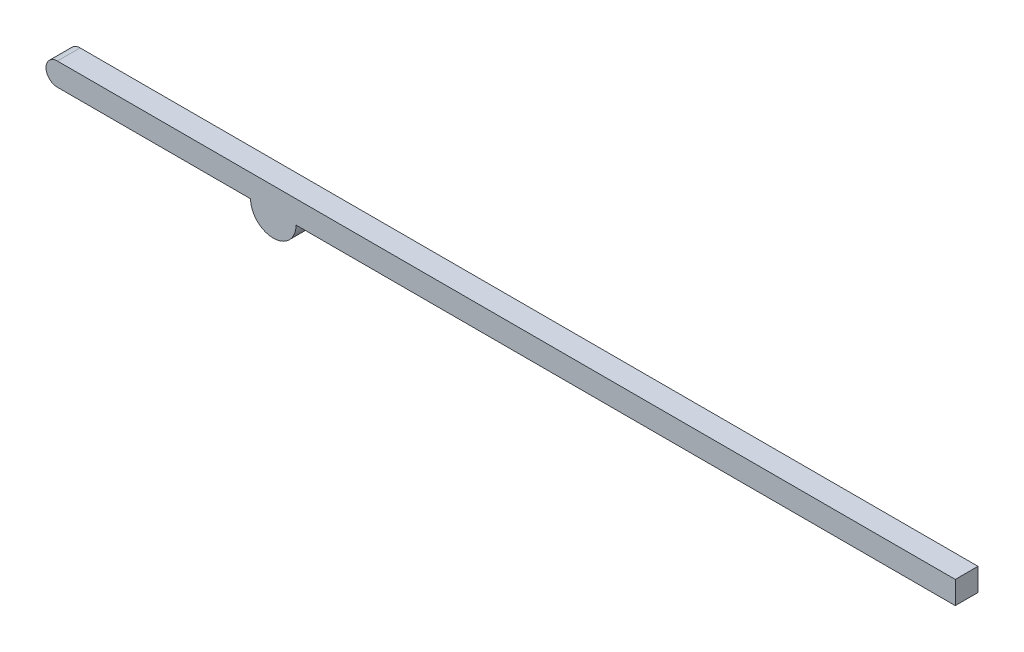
from build123d import *

# Parameters (mm, degrees)
SKETCH1_W                = 200
SKETCH1_H                = 5
BOSS_EXTRUDE1_DEPTH      = 2.5
BOSS_EXTRUDE2_DEPTH      = 2.5
BOSS_EXTRUDE2_DEPTH_BACK = 2.5
SKETCH2_R                = 5
FILLET1_RADIUS           = 2.5
FILLET1_LENGTH           = 5


with BuildPart() as part:
    # Sketch1 → Boss-Extrude1 (new, symmetric)
    with BuildSketch(Plane.XY):
        Rectangle(SKETCH1_W, SKETCH1_H)
    extrude(amount=BOSS_EXTRUDE1_DEPTH, both=True)

    # Sketch2 → Boss-Extrude2 (add, two sides: drawn at the far end of the back side and taken through both)
    with BuildSketch(Plane.XY.offset(-BOSS_EXTRUDE2_DEPTH_BACK)):
        with Locations((-50, -2.5)):
            Circle(SKETCH2_R)
    extrude(amount=BOSS_EXTRUDE2_DEPTH + BOSS_EXTRUDE2_DEPTH_BACK)

    # Fillet1: full round fillet: the end face becomes a half cylinder, R = half its width
    fillet1_face = Plane((-100, 0, 0), x_dir=(0, 0, -1), z_dir=(-1, 0, 0))  # on the end face: x along it, z out of the body
    fillet1_slab = fillet1_face.offset(-FILLET1_RADIUS / 2) * Box(FILLET1_LENGTH, 2 * FILLET1_RADIUS, FILLET1_RADIUS, mode=Mode.PRIVATE)  # the body's end, R deep
    fillet1_round = Plane((-97.5, 0, 0), x_dir=(-1, 0, 0), z_dir=(0, 0, -1)) * Cylinder(FILLET1_RADIUS, FILLET1_LENGTH, mode=Mode.PRIVATE)  # its axis R under the face
    add(fillet1_slab - fillet1_round, mode=Mode.SUBTRACT)


solid = part.part
